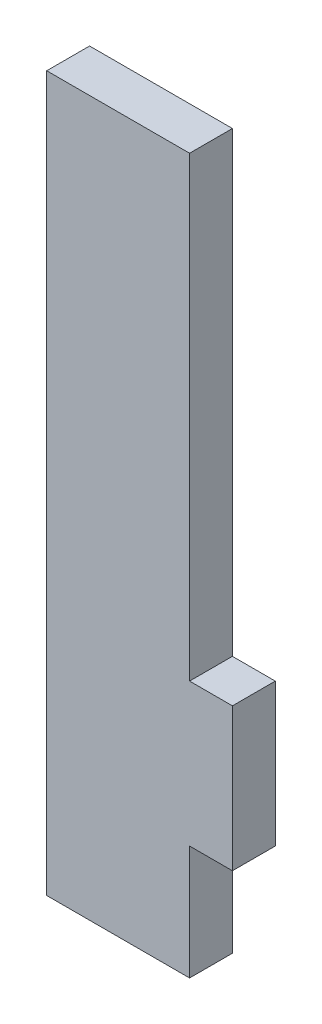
ISO-10303-21;
HEADER;
FILE_DESCRIPTION(('STEP AP214'),'2;1');
FILE_NAME('part.step','',(''),(''),'','','');
FILE_SCHEMA(('AUTOMOTIVE_DESIGN { 1 0 10303 214 1 1 1 1 }'));
ENDSEC;
DATA;
#1=APPLICATION_CONTEXT('core data for automotive mechanical design processes');
#2=APPLICATION_PROTOCOL_DEFINITION('international standard','automotive_design',2000,#1);
#3=PRODUCT_CONTEXT('',#1,'mechanical');
#4=PRODUCT('Part','Part','',(#3));
#5=PRODUCT_RELATED_PRODUCT_CATEGORY('part','',(#4));
#6=PRODUCT_DEFINITION_FORMATION('','',#4);
#7=PRODUCT_DEFINITION_CONTEXT('part definition',#1,'design');
#8=PRODUCT_DEFINITION('design','',#6,#7);
#9=PRODUCT_DEFINITION_SHAPE('','',#8);
#10=(LENGTH_UNIT() NAMED_UNIT(*) SI_UNIT(.MILLI.,.METRE.));
#11=(NAMED_UNIT(*) PLANE_ANGLE_UNIT() SI_UNIT($,.RADIAN.));
#12=(NAMED_UNIT(*) SI_UNIT($,.STERADIAN.) SOLID_ANGLE_UNIT());
#13=UNCERTAINTY_MEASURE_WITH_UNIT(LENGTH_MEASURE(1.E-05),#10,'distance_accuracy_value','');
#14=(GEOMETRIC_REPRESENTATION_CONTEXT(3) GLOBAL_UNCERTAINTY_ASSIGNED_CONTEXT((#13)) GLOBAL_UNIT_ASSIGNED_CONTEXT((#10,
#11,#12)) REPRESENTATION_CONTEXT('',''));
#15=CARTESIAN_POINT('',(0.,0.,0.));
#16=DIRECTION('',(0.,0.,1.));
#17=DIRECTION('',(1.,0.,0.));
#18=AXIS2_PLACEMENT_3D('',#15,#16,#17);
#19=CARTESIAN_POINT('',(0.,0.,3.));
#20=DIRECTION('',(1.,0.,0.));
#21=DIRECTION('',(0.,0.,-1.));
#22=AXIS2_PLACEMENT_3D('',#19,#20,#21);
#23=PLANE('',#22);
#24=DIRECTION('',(0.,-1.,0.));
#25=VECTOR('',#24,1.);
#26=CARTESIAN_POINT('',(0.,0.,0.));
#27=LINE('',#26,#25);
#28=CARTESIAN_POINT('',(0.,45.,0.));
#29=VERTEX_POINT('',#28);
#30=CARTESIAN_POINT('',(0.,-5.,0.));
#31=VERTEX_POINT('',#30);
#32=EDGE_CURVE('E122',#29,#31,#27,.T.);
#33=ORIENTED_EDGE('',*,*,#32,.T.);
#34=DIRECTION('',(0.,0.,-1.));
#35=VECTOR('',#34,1.);
#36=CARTESIAN_POINT('',(0.,-5.,3.));
#37=LINE('',#36,#35);
#38=CARTESIAN_POINT('',(0.,-5.,3.));
#39=VERTEX_POINT('',#38);
#40=EDGE_CURVE('E158',#39,#31,#37,.T.);
#41=ORIENTED_EDGE('',*,*,#40,.F.);
#42=DIRECTION('',(0.,-1.,0.));
#43=VECTOR('',#42,1.);
#44=CARTESIAN_POINT('',(0.,0.,3.));
#45=LINE('',#44,#43);
#46=CARTESIAN_POINT('',(0.,45.,3.));
#47=VERTEX_POINT('',#46);
#48=EDGE_CURVE('E135',#47,#39,#45,.T.);
#49=ORIENTED_EDGE('',*,*,#48,.F.);
#50=DIRECTION('',(0.,0.,-1.));
#51=VECTOR('',#50,1.);
#52=CARTESIAN_POINT('',(0.,45.,3.));
#53=LINE('',#52,#51);
#54=EDGE_CURVE('E118',#47,#29,#53,.T.);
#55=ORIENTED_EDGE('',*,*,#54,.T.);
#56=EDGE_LOOP('',(#33,#41,#49,#55));
#57=FACE_BOUND('',#56,.T.);
#58=ADVANCED_FACE('F34',(#57),#23,.F.);
#59=CARTESIAN_POINT('',(10.,0.,3.));
#60=DIRECTION('',(-1.,0.,0.));
#61=DIRECTION('',(0.,0.,1.));
#62=AXIS2_PLACEMENT_3D('',#59,#60,#61);
#63=PLANE('',#62);
#64=DIRECTION('',(0.,1.,0.));
#65=VECTOR('',#64,1.);
#66=CARTESIAN_POINT('',(10.,0.,0.));
#67=LINE('',#66,#65);
#68=CARTESIAN_POINT('',(10.,-5.,0.));
#69=VERTEX_POINT('',#68);
#70=CARTESIAN_POINT('',(10.,3.,0.));
#71=VERTEX_POINT('',#70);
#72=EDGE_CURVE('E125',#69,#71,#67,.T.);
#73=ORIENTED_EDGE('',*,*,#72,.T.);
#74=DIRECTION('',(0.,0.,-1.));
#75=VECTOR('',#74,1.);
#76=CARTESIAN_POINT('',(10.,3.,3.));
#77=LINE('',#76,#75);
#78=CARTESIAN_POINT('',(10.,3.,3.));
#79=VERTEX_POINT('',#78);
#80=EDGE_CURVE('E11',#79,#71,#77,.T.);
#81=ORIENTED_EDGE('',*,*,#80,.F.);
#82=DIRECTION('',(0.,1.,0.));
#83=VECTOR('',#82,1.);
#84=CARTESIAN_POINT('',(10.,0.,3.));
#85=LINE('',#84,#83);
#86=CARTESIAN_POINT('',(10.,-5.,3.));
#87=VERTEX_POINT('',#86);
#88=EDGE_CURVE('E88',#87,#79,#85,.T.);
#89=ORIENTED_EDGE('',*,*,#88,.F.);
#90=DIRECTION('',(0.,0.,1.));
#91=VECTOR('',#90,1.);
#92=CARTESIAN_POINT('',(10.,-5.,0.));
#93=LINE('',#92,#91);
#94=EDGE_CURVE('E170',#69,#87,#93,.T.);
#95=ORIENTED_EDGE('',*,*,#94,.F.);
#96=EDGE_LOOP('',(#73,#81,#89,#95));
#97=FACE_BOUND('',#96,.T.);
#98=ADVANCED_FACE('F178',(#97),#63,.F.);
#99=CARTESIAN_POINT('',(10.,3.,3.));
#100=DIRECTION('',(0.,1.,0.));
#101=DIRECTION('',(0.,0.,1.));
#102=AXIS2_PLACEMENT_3D('',#99,#100,#101);
#103=PLANE('',#102);
#104=DIRECTION('',(1.,0.,0.));
#105=VECTOR('',#104,1.);
#106=CARTESIAN_POINT('',(10.,3.,0.));
#107=LINE('',#106,#105);
#108=CARTESIAN_POINT('',(13.,3.,0.));
#109=VERTEX_POINT('',#108);
#110=EDGE_CURVE('E128',#71,#109,#107,.T.);
#111=ORIENTED_EDGE('',*,*,#110,.T.);
#112=DIRECTION('',(0.,0.,-1.));
#113=VECTOR('',#112,1.);
#114=CARTESIAN_POINT('',(13.,3.,3.));
#115=LINE('',#114,#113);
#116=CARTESIAN_POINT('',(13.,3.,3.));
#117=VERTEX_POINT('',#116);
#118=EDGE_CURVE('E42',#117,#109,#115,.T.);
#119=ORIENTED_EDGE('',*,*,#118,.F.);
#120=DIRECTION('',(1.,0.,0.));
#121=VECTOR('',#120,1.);
#122=CARTESIAN_POINT('',(10.,3.,3.));
#123=LINE('',#122,#121);
#124=EDGE_CURVE('E176',#79,#117,#123,.T.);
#125=ORIENTED_EDGE('',*,*,#124,.F.);
#126=ORIENTED_EDGE('',*,*,#80,.T.);
#127=EDGE_LOOP('',(#111,#119,#125,#126));
#128=FACE_BOUND('',#127,.T.);
#129=ADVANCED_FACE('F177',(#128),#103,.F.);
#130=CARTESIAN_POINT('',(13.,3.,3.));
#131=DIRECTION('',(-1.,0.,0.));
#132=DIRECTION('',(0.,0.,1.));
#133=AXIS2_PLACEMENT_3D('',#130,#131,#132);
#134=PLANE('',#133);
#135=DIRECTION('',(0.,1.,0.));
#136=VECTOR('',#135,1.);
#137=CARTESIAN_POINT('',(13.,3.,0.));
#138=LINE('',#137,#136);
#139=CARTESIAN_POINT('',(13.,13.,0.));
#140=VERTEX_POINT('',#139);
#141=EDGE_CURVE('E130',#109,#140,#138,.T.);
#142=ORIENTED_EDGE('',*,*,#141,.T.);
#143=DIRECTION('',(0.,0.,-1.));
#144=VECTOR('',#143,1.);
#145=CARTESIAN_POINT('',(13.,13.,3.));
#146=LINE('',#145,#144);
#147=CARTESIAN_POINT('',(13.,13.,3.));
#148=VERTEX_POINT('',#147);
#149=EDGE_CURVE('E113',#148,#140,#146,.T.);
#150=ORIENTED_EDGE('',*,*,#149,.F.);
#151=DIRECTION('',(0.,1.,0.));
#152=VECTOR('',#151,1.);
#153=CARTESIAN_POINT('',(13.,3.,3.));
#154=LINE('',#153,#152);
#155=EDGE_CURVE('E104',#117,#148,#154,.T.);
#156=ORIENTED_EDGE('',*,*,#155,.F.);
#157=ORIENTED_EDGE('',*,*,#118,.T.);
#158=EDGE_LOOP('',(#142,#150,#156,#157));
#159=FACE_BOUND('',#158,.T.);
#160=ADVANCED_FACE('F142',(#159),#134,.F.);
#161=CARTESIAN_POINT('',(10.,13.,3.));
#162=DIRECTION('',(0.,-1.,0.));
#163=DIRECTION('',(0.,0.,-1.));
#164=AXIS2_PLACEMENT_3D('',#161,#162,#163);
#165=PLANE('',#164);
#166=DIRECTION('',(-1.,0.,0.));
#167=VECTOR('',#166,1.);
#168=CARTESIAN_POINT('',(10.,13.,0.));
#169=LINE('',#168,#167);
#170=CARTESIAN_POINT('',(10.,13.,0.));
#171=VERTEX_POINT('',#170);
#172=EDGE_CURVE('E112',#140,#171,#169,.T.);
#173=ORIENTED_EDGE('',*,*,#172,.T.);
#174=DIRECTION('',(0.,0.,-1.));
#175=VECTOR('',#174,1.);
#176=CARTESIAN_POINT('',(10.,13.,3.));
#177=LINE('',#176,#175);
#178=CARTESIAN_POINT('',(10.,13.,3.));
#179=VERTEX_POINT('',#178);
#180=EDGE_CURVE('E109',#179,#171,#177,.T.);
#181=ORIENTED_EDGE('',*,*,#180,.F.);
#182=DIRECTION('',(-1.,0.,0.));
#183=VECTOR('',#182,1.);
#184=CARTESIAN_POINT('',(10.,13.,3.));
#185=LINE('',#184,#183);
#186=EDGE_CURVE('E98',#148,#179,#185,.T.);
#187=ORIENTED_EDGE('',*,*,#186,.F.);
#188=ORIENTED_EDGE('',*,*,#149,.T.);
#189=EDGE_LOOP('',(#173,#181,#187,#188));
#190=FACE_BOUND('',#189,.T.);
#191=ADVANCED_FACE('F110',(#190),#165,.F.);
#192=CARTESIAN_POINT('',(10.,13.,3.));
#193=DIRECTION('',(-1.,0.,0.));
#194=DIRECTION('',(0.,0.,1.));
#195=AXIS2_PLACEMENT_3D('',#192,#193,#194);
#196=PLANE('',#195);
#197=DIRECTION('',(0.,1.,0.));
#198=VECTOR('',#197,1.);
#199=CARTESIAN_POINT('',(10.,13.,0.));
#200=LINE('',#199,#198);
#201=CARTESIAN_POINT('',(10.,45.,0.));
#202=VERTEX_POINT('',#201);
#203=EDGE_CURVE('E74',#171,#202,#200,.T.);
#204=ORIENTED_EDGE('',*,*,#203,.T.);
#205=DIRECTION('',(0.,0.,-1.));
#206=VECTOR('',#205,1.);
#207=CARTESIAN_POINT('',(10.,45.,3.));
#208=LINE('',#207,#206);
#209=CARTESIAN_POINT('',(10.,45.,3.));
#210=VERTEX_POINT('',#209);
#211=EDGE_CURVE('E114',#210,#202,#208,.T.);
#212=ORIENTED_EDGE('',*,*,#211,.F.);
#213=DIRECTION('',(0.,1.,0.));
#214=VECTOR('',#213,1.);
#215=CARTESIAN_POINT('',(10.,13.,3.));
#216=LINE('',#215,#214);
#217=EDGE_CURVE('E102',#179,#210,#216,.T.);
#218=ORIENTED_EDGE('',*,*,#217,.F.);
#219=ORIENTED_EDGE('',*,*,#180,.T.);
#220=EDGE_LOOP('',(#204,#212,#218,#219));
#221=FACE_BOUND('',#220,.T.);
#222=ADVANCED_FACE('F116',(#221),#196,.F.);
#223=CARTESIAN_POINT('',(0.,45.,3.));
#224=DIRECTION('',(0.,-1.,0.));
#225=DIRECTION('',(0.,0.,-1.));
#226=AXIS2_PLACEMENT_3D('',#223,#224,#225);
#227=PLANE('',#226);
#228=DIRECTION('',(-1.,0.,0.));
#229=VECTOR('',#228,1.);
#230=CARTESIAN_POINT('',(0.,45.,0.));
#231=LINE('',#230,#229);
#232=EDGE_CURVE('E80',#202,#29,#231,.T.);
#233=ORIENTED_EDGE('',*,*,#232,.T.);
#234=ORIENTED_EDGE('',*,*,#54,.F.);
#235=DIRECTION('',(-1.,0.,0.));
#236=VECTOR('',#235,1.);
#237=CARTESIAN_POINT('',(0.,45.,3.));
#238=LINE('',#237,#236);
#239=EDGE_CURVE('E50',#210,#47,#238,.T.);
#240=ORIENTED_EDGE('',*,*,#239,.F.);
#241=ORIENTED_EDGE('',*,*,#211,.T.);
#242=EDGE_LOOP('',(#233,#234,#240,#241));
#243=FACE_BOUND('',#242,.T.);
#244=ADVANCED_FACE('F193',(#243),#227,.F.);
#245=CARTESIAN_POINT('',(0.,0.,3.));
#246=DIRECTION('',(0.,0.,-1.));
#247=DIRECTION('',(-1.,0.,0.));
#248=AXIS2_PLACEMENT_3D('',#245,#246,#247);
#249=PLANE('',#248);
#250=ORIENTED_EDGE('',*,*,#48,.T.);
#251=DIRECTION('',(-1.,0.,0.));
#252=VECTOR('',#251,1.);
#253=CARTESIAN_POINT('',(10.,-5.,3.));
#254=LINE('',#253,#252);
#255=EDGE_CURVE('E126',#87,#39,#254,.T.);
#256=ORIENTED_EDGE('',*,*,#255,.F.);
#257=ORIENTED_EDGE('',*,*,#88,.T.);
#258=ORIENTED_EDGE('',*,*,#124,.T.);
#259=ORIENTED_EDGE('',*,*,#155,.T.);
#260=ORIENTED_EDGE('',*,*,#186,.T.);
#261=ORIENTED_EDGE('',*,*,#217,.T.);
#262=ORIENTED_EDGE('',*,*,#239,.T.);
#263=EDGE_LOOP('',(#250,#256,#257,#258,#259,#260,#261,#262));
#264=FACE_BOUND('',#263,.T.);
#265=ADVANCED_FACE('F100',(#264),#249,.F.);
#266=CARTESIAN_POINT('',(0.,0.,0.));
#267=DIRECTION('',(0.,0.,-1.));
#268=DIRECTION('',(-1.,0.,0.));
#269=AXIS2_PLACEMENT_3D('',#266,#267,#268);
#270=PLANE('',#269);
#271=ORIENTED_EDGE('',*,*,#32,.F.);
#272=ORIENTED_EDGE('',*,*,#232,.F.);
#273=ORIENTED_EDGE('',*,*,#203,.F.);
#274=ORIENTED_EDGE('',*,*,#172,.F.);
#275=ORIENTED_EDGE('',*,*,#141,.F.);
#276=ORIENTED_EDGE('',*,*,#110,.F.);
#277=ORIENTED_EDGE('',*,*,#72,.F.);
#278=DIRECTION('',(1.,0.,0.));
#279=VECTOR('',#278,1.);
#280=CARTESIAN_POINT('',(0.,-5.,0.));
#281=LINE('',#280,#279);
#282=EDGE_CURVE('E153',#31,#69,#281,.T.);
#283=ORIENTED_EDGE('',*,*,#282,.F.);
#284=EDGE_LOOP('',(#271,#272,#273,#274,#275,#276,#277,#283));
#285=FACE_BOUND('',#284,.T.);
#286=ADVANCED_FACE('F148',(#285),#270,.T.);
#287=CARTESIAN_POINT('',(0.,-5.,0.));
#288=DIRECTION('',(0.,-1.,0.));
#289=DIRECTION('',(0.,0.,-1.));
#290=AXIS2_PLACEMENT_3D('',#287,#288,#289);
#291=PLANE('',#290);
#292=ORIENTED_EDGE('',*,*,#40,.T.);
#293=ORIENTED_EDGE('',*,*,#282,.T.);
#294=ORIENTED_EDGE('',*,*,#94,.T.);
#295=ORIENTED_EDGE('',*,*,#255,.T.);
#296=EDGE_LOOP('',(#292,#293,#294,#295));
#297=FACE_BOUND('',#296,.T.);
#298=ADVANCED_FACE('F169',(#297),#291,.T.);
#299=CLOSED_SHELL('',(#58,#98,#129,#160,#191,#222,#244,#265,#286,#298));
#300=MANIFOLD_SOLID_BREP('B2',#299);
#301=ADVANCED_BREP_SHAPE_REPRESENTATION('',(#18,#300),#14);
#302=SHAPE_DEFINITION_REPRESENTATION(#9,#301);
ENDSEC;
END-ISO-10303-21;
